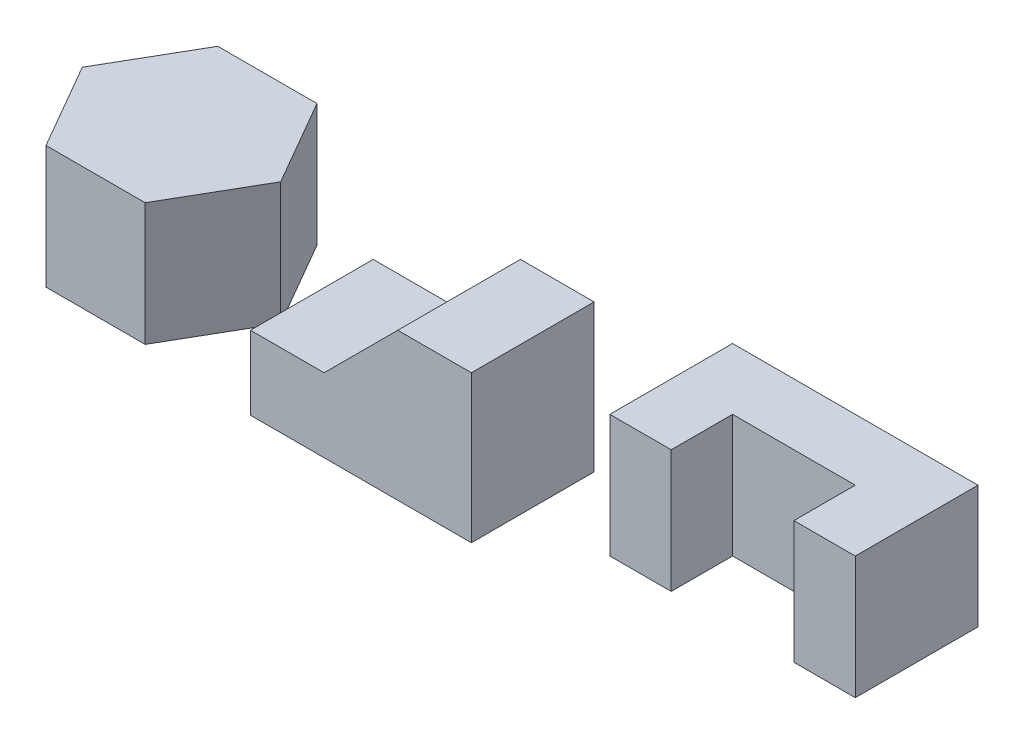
ISO-10303-21;
HEADER;
FILE_DESCRIPTION(('STEP AP214'),'2;1');
FILE_NAME('part.step','',(''),(''),'','','');
FILE_SCHEMA(('AUTOMOTIVE_DESIGN { 1 0 10303 214 1 1 1 1 }'));
ENDSEC;
DATA;
#1=APPLICATION_CONTEXT('core data for automotive mechanical design processes');
#2=APPLICATION_PROTOCOL_DEFINITION('international standard','automotive_design',2000,#1);
#3=PRODUCT_CONTEXT('',#1,'mechanical');
#4=PRODUCT('Part','Part','',(#3));
#5=PRODUCT_RELATED_PRODUCT_CATEGORY('part','',(#4));
#6=PRODUCT_DEFINITION_FORMATION('','',#4);
#7=PRODUCT_DEFINITION_CONTEXT('part definition',#1,'design');
#8=PRODUCT_DEFINITION('design','',#6,#7);
#9=PRODUCT_DEFINITION_SHAPE('','',#8);
#10=(LENGTH_UNIT() NAMED_UNIT(*) SI_UNIT(.MILLI.,.METRE.));
#11=(NAMED_UNIT(*) PLANE_ANGLE_UNIT() SI_UNIT($,.RADIAN.));
#12=(NAMED_UNIT(*) SI_UNIT($,.STERADIAN.) SOLID_ANGLE_UNIT());
#13=UNCERTAINTY_MEASURE_WITH_UNIT(LENGTH_MEASURE(1.E-05),#10,'distance_accuracy_value','');
#14=(GEOMETRIC_REPRESENTATION_CONTEXT(3) GLOBAL_UNCERTAINTY_ASSIGNED_CONTEXT((#13)) GLOBAL_UNIT_ASSIGNED_CONTEXT((#10,
#11,#12)) REPRESENTATION_CONTEXT('',''));
#15=CARTESIAN_POINT('',(0.,0.,0.));
#16=DIRECTION('',(0.,0.,1.));
#17=DIRECTION('',(1.,0.,0.));
#18=AXIS2_PLACEMENT_3D('',#15,#16,#17);
#19=CARTESIAN_POINT('',(21.6218730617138,8.29106988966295,10.));
#20=DIRECTION('',(0.,-1.,0.));
#21=DIRECTION('',(0.,0.,-1.));
#22=AXIS2_PLACEMENT_3D('',#19,#20,#21);
#23=PLANE('',#22);
#24=DIRECTION('',(-1.,0.,0.));
#25=VECTOR('',#24,1.);
#26=CARTESIAN_POINT('',(21.6218730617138,8.29106988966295,0.));
#27=LINE('',#26,#25);
#28=CARTESIAN_POINT('',(21.6218730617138,8.29106988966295,0.));
#29=VERTEX_POINT('',#28);
#30=CARTESIAN_POINT('',(15.6218730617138,8.29106988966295,0.));
#31=VERTEX_POINT('',#30);
#32=EDGE_CURVE('E126',#29,#31,#27,.T.);
#33=ORIENTED_EDGE('',*,*,#32,.T.);
#34=DIRECTION('',(0.,0.,-1.));
#35=VECTOR('',#34,1.);
#36=CARTESIAN_POINT('',(15.6218730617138,8.29106988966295,10.));
#37=LINE('',#36,#35);
#38=CARTESIAN_POINT('',(15.6218730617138,8.29106988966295,10.));
#39=VERTEX_POINT('',#38);
#40=EDGE_CURVE('E12',#39,#31,#37,.T.);
#41=ORIENTED_EDGE('',*,*,#40,.F.);
#42=DIRECTION('',(-1.,0.,0.));
#43=VECTOR('',#42,1.);
#44=CARTESIAN_POINT('',(21.6218730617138,8.29106988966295,10.));
#45=LINE('',#44,#43);
#46=CARTESIAN_POINT('',(21.6218730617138,8.29106988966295,10.));
#47=VERTEX_POINT('',#46);
#48=EDGE_CURVE('E136',#47,#39,#45,.T.);
#49=ORIENTED_EDGE('',*,*,#48,.F.);
#50=DIRECTION('',(0.,0.,-1.));
#51=VECTOR('',#50,1.);
#52=CARTESIAN_POINT('',(21.6218730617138,8.29106988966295,10.));
#53=LINE('',#52,#51);
#54=EDGE_CURVE('E122',#47,#29,#53,.T.);
#55=ORIENTED_EDGE('',*,*,#54,.T.);
#56=EDGE_LOOP('',(#33,#41,#49,#55));
#57=FACE_BOUND('',#56,.T.);
#58=ADVANCED_FACE('F42',(#57),#23,.F.);
#59=CARTESIAN_POINT('',(15.6218730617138,8.29106988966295,10.));
#60=DIRECTION('',(1.,0.,0.));
#61=DIRECTION('',(0.,1.,0.));
#62=AXIS2_PLACEMENT_3D('',#59,#60,#61);
#63=PLANE('',#62);
#64=DIRECTION('',(0.,-1.,0.));
#65=VECTOR('',#64,1.);
#66=CARTESIAN_POINT('',(15.6218730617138,8.29106988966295,0.));
#67=LINE('',#66,#65);
#68=CARTESIAN_POINT('',(15.6218730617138,2.29106988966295,0.));
#69=VERTEX_POINT('',#68);
#70=EDGE_CURVE('E129',#31,#69,#67,.T.);
#71=ORIENTED_EDGE('',*,*,#70,.T.);
#72=DIRECTION('',(0.,0.,-1.));
#73=VECTOR('',#72,1.);
#74=CARTESIAN_POINT('',(15.6218730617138,2.29106988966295,10.));
#75=LINE('',#74,#73);
#76=CARTESIAN_POINT('',(15.6218730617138,2.29106988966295,10.));
#77=VERTEX_POINT('',#76);
#78=EDGE_CURVE('E50',#77,#69,#75,.T.);
#79=ORIENTED_EDGE('',*,*,#78,.F.);
#80=DIRECTION('',(0.,-1.,0.));
#81=VECTOR('',#80,1.);
#82=CARTESIAN_POINT('',(15.6218730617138,8.29106988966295,10.));
#83=LINE('',#82,#81);
#84=EDGE_CURVE('E95',#39,#77,#83,.T.);
#85=ORIENTED_EDGE('',*,*,#84,.F.);
#86=ORIENTED_EDGE('',*,*,#40,.T.);
#87=EDGE_LOOP('',(#71,#79,#85,#86));
#88=FACE_BOUND('',#87,.T.);
#89=ADVANCED_FACE('F160',(#88),#63,.F.);
#90=CARTESIAN_POINT('',(15.6218730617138,2.29106988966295,10.));
#91=DIRECTION('',(0.,1.,0.));
#92=DIRECTION('',(0.,0.,1.));
#93=AXIS2_PLACEMENT_3D('',#90,#91,#92);
#94=PLANE('',#93);
#95=DIRECTION('',(1.,0.,0.));
#96=VECTOR('',#95,1.);
#97=CARTESIAN_POINT('',(15.6218730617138,2.29106988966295,0.));
#98=LINE('',#97,#96);
#99=CARTESIAN_POINT('',(33.6218730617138,2.29106988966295,0.));
#100=VERTEX_POINT('',#99);
#101=EDGE_CURVE('E131',#69,#100,#98,.T.);
#102=ORIENTED_EDGE('',*,*,#101,.T.);
#103=DIRECTION('',(0.,0.,-1.));
#104=VECTOR('',#103,1.);
#105=CARTESIAN_POINT('',(33.6218730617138,2.29106988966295,10.));
#106=LINE('',#105,#104);
#107=CARTESIAN_POINT('',(33.6218730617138,2.29106988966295,10.));
#108=VERTEX_POINT('',#107);
#109=EDGE_CURVE('E117',#108,#100,#106,.T.);
#110=ORIENTED_EDGE('',*,*,#109,.F.);
#111=DIRECTION('',(1.,0.,0.));
#112=VECTOR('',#111,1.);
#113=CARTESIAN_POINT('',(15.6218730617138,2.29106988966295,10.));
#114=LINE('',#113,#112);
#115=EDGE_CURVE('E108',#77,#108,#114,.T.);
#116=ORIENTED_EDGE('',*,*,#115,.F.);
#117=ORIENTED_EDGE('',*,*,#78,.T.);
#118=EDGE_LOOP('',(#102,#110,#116,#117));
#119=FACE_BOUND('',#118,.T.);
#120=ADVANCED_FACE('F142',(#119),#94,.F.);
#121=CARTESIAN_POINT('',(33.6218730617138,2.29106988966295,10.));
#122=DIRECTION('',(-1.,0.,0.));
#123=DIRECTION('',(0.,0.,1.));
#124=AXIS2_PLACEMENT_3D('',#121,#122,#123);
#125=PLANE('',#124);
#126=DIRECTION('',(0.,1.,0.));
#127=VECTOR('',#126,1.);
#128=CARTESIAN_POINT('',(33.6218730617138,2.29106988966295,0.));
#129=LINE('',#128,#127);
#130=CARTESIAN_POINT('',(33.6218730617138,14.2910698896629,0.));
#131=VERTEX_POINT('',#130);
#132=EDGE_CURVE('E116',#100,#131,#129,.T.);
#133=ORIENTED_EDGE('',*,*,#132,.T.);
#134=DIRECTION('',(0.,0.,-1.));
#135=VECTOR('',#134,1.);
#136=CARTESIAN_POINT('',(33.6218730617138,14.2910698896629,10.));
#137=LINE('',#136,#135);
#138=CARTESIAN_POINT('',(33.6218730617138,14.2910698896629,10.));
#139=VERTEX_POINT('',#138);
#140=EDGE_CURVE('E113',#139,#131,#137,.T.);
#141=ORIENTED_EDGE('',*,*,#140,.F.);
#142=DIRECTION('',(0.,1.,0.));
#143=VECTOR('',#142,1.);
#144=CARTESIAN_POINT('',(33.6218730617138,2.29106988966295,10.));
#145=LINE('',#144,#143);
#146=EDGE_CURVE('E102',#108,#139,#145,.T.);
#147=ORIENTED_EDGE('',*,*,#146,.F.);
#148=ORIENTED_EDGE('',*,*,#109,.T.);
#149=EDGE_LOOP('',(#133,#141,#147,#148));
#150=FACE_BOUND('',#149,.T.);
#151=ADVANCED_FACE('F114',(#150),#125,.F.);
#152=CARTESIAN_POINT('',(33.6218730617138,14.2910698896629,10.));
#153=DIRECTION('',(0.,-1.,0.));
#154=DIRECTION('',(1.,0.,0.));
#155=AXIS2_PLACEMENT_3D('',#152,#153,#154);
#156=PLANE('',#155);
#157=DIRECTION('',(-1.,0.,0.));
#158=VECTOR('',#157,1.);
#159=CARTESIAN_POINT('',(33.6218730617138,14.2910698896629,0.));
#160=LINE('',#159,#158);
#161=CARTESIAN_POINT('',(27.6218730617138,14.2910698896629,0.));
#162=VERTEX_POINT('',#161);
#163=EDGE_CURVE('E81',#131,#162,#160,.T.);
#164=ORIENTED_EDGE('',*,*,#163,.T.);
#165=DIRECTION('',(0.,0.,-1.));
#166=VECTOR('',#165,1.);
#167=CARTESIAN_POINT('',(27.6218730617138,14.2910698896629,10.));
#168=LINE('',#167,#166);
#169=CARTESIAN_POINT('',(27.6218730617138,14.2910698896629,10.));
#170=VERTEX_POINT('',#169);
#171=EDGE_CURVE('E118',#170,#162,#168,.T.);
#172=ORIENTED_EDGE('',*,*,#171,.F.);
#173=DIRECTION('',(-1.,0.,0.));
#174=VECTOR('',#173,1.);
#175=CARTESIAN_POINT('',(33.6218730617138,14.2910698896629,10.));
#176=LINE('',#175,#174);
#177=EDGE_CURVE('E106',#139,#170,#176,.T.);
#178=ORIENTED_EDGE('',*,*,#177,.F.);
#179=ORIENTED_EDGE('',*,*,#140,.T.);
#180=EDGE_LOOP('',(#164,#172,#178,#179));
#181=FACE_BOUND('',#180,.T.);
#182=ADVANCED_FACE('F120',(#181),#156,.F.);
#183=CARTESIAN_POINT('',(27.6218730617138,14.2910698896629,10.));
#184=DIRECTION('',(0.707106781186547,-0.707106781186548,0.));
#185=DIRECTION('',(0.707106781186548,0.707106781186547,0.));
#186=AXIS2_PLACEMENT_3D('',#183,#184,#185);
#187=PLANE('',#186);
#188=DIRECTION('',(-0.707106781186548,-0.707106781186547,0.));
#189=VECTOR('',#188,1.);
#190=CARTESIAN_POINT('',(27.6218730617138,14.2910698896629,0.));
#191=LINE('',#190,#189);
#192=EDGE_CURVE('E87',#162,#29,#191,.T.);
#193=ORIENTED_EDGE('',*,*,#192,.T.);
#194=ORIENTED_EDGE('',*,*,#54,.F.);
#195=DIRECTION('',(-0.707106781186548,-0.707106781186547,0.));
#196=VECTOR('',#195,1.);
#197=CARTESIAN_POINT('',(27.6218730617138,14.2910698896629,10.));
#198=LINE('',#197,#196);
#199=EDGE_CURVE('E58',#170,#47,#198,.T.);
#200=ORIENTED_EDGE('',*,*,#199,.F.);
#201=ORIENTED_EDGE('',*,*,#171,.T.);
#202=EDGE_LOOP('',(#193,#194,#200,#201));
#203=FACE_BOUND('',#202,.T.);
#204=ADVANCED_FACE('F149',(#203),#187,.F.);
#205=CARTESIAN_POINT('',(15.6218730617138,8.29106988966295,10.));
#206=DIRECTION('',(0.,0.,1.));
#207=DIRECTION('',(1.,0.,0.));
#208=AXIS2_PLACEMENT_3D('',#205,#206,#207);
#209=PLANE('',#208);
#210=ORIENTED_EDGE('',*,*,#48,.T.);
#211=ORIENTED_EDGE('',*,*,#84,.T.);
#212=ORIENTED_EDGE('',*,*,#115,.T.);
#213=ORIENTED_EDGE('',*,*,#146,.T.);
#214=ORIENTED_EDGE('',*,*,#177,.T.);
#215=ORIENTED_EDGE('',*,*,#199,.T.);
#216=EDGE_LOOP('',(#210,#211,#212,#213,#214,#215));
#217=FACE_BOUND('',#216,.T.);
#218=ADVANCED_FACE('F104',(#217),#209,.T.);
#219=CARTESIAN_POINT('',(15.6218730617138,8.29106988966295,0.));
#220=DIRECTION('',(0.,0.,1.));
#221=DIRECTION('',(1.,0.,0.));
#222=AXIS2_PLACEMENT_3D('',#219,#220,#221);
#223=PLANE('',#222);
#224=ORIENTED_EDGE('',*,*,#32,.F.);
#225=ORIENTED_EDGE('',*,*,#192,.F.);
#226=ORIENTED_EDGE('',*,*,#163,.F.);
#227=ORIENTED_EDGE('',*,*,#132,.F.);
#228=ORIENTED_EDGE('',*,*,#101,.F.);
#229=ORIENTED_EDGE('',*,*,#70,.F.);
#230=EDGE_LOOP('',(#224,#225,#226,#227,#228,#229));
#231=FACE_BOUND('',#230,.T.);
#232=ADVANCED_FACE('F145',(#231),#223,.F.);
#233=CLOSED_SHELL('',(#58,#89,#120,#151,#182,#204,#218,#232));
#234=MANIFOLD_SOLID_BREP('B2',#233);
#235=CARTESIAN_POINT('',(37.9066140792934,10.,-7.00000000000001));
#236=DIRECTION('',(1.,0.,0.));
#237=DIRECTION('',(0.,0.,-1.));
#238=AXIS2_PLACEMENT_3D('',#235,#236,#237);
#239=PLANE('',#238);
#240=DIRECTION('',(0.,0.,1.));
#241=VECTOR('',#240,1.);
#242=CARTESIAN_POINT('',(37.9066140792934,0.,-7.00000000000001));
#243=LINE('',#242,#241);
#244=CARTESIAN_POINT('',(37.9066140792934,0.,-7.00000000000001));
#245=VERTEX_POINT('',#244);
#246=CARTESIAN_POINT('',(37.9066140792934,0.,3.));
#247=VERTEX_POINT('',#246);
#248=EDGE_CURVE('E323',#245,#247,#243,.T.);
#249=ORIENTED_EDGE('',*,*,#248,.T.);
#250=DIRECTION('',(0.,-1.,0.));
#251=VECTOR('',#250,1.);
#252=CARTESIAN_POINT('',(37.9066140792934,10.,3.));
#253=LINE('',#252,#251);
#254=CARTESIAN_POINT('',(37.9066140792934,10.,3.));
#255=VERTEX_POINT('',#254);
#256=EDGE_CURVE('E40',#255,#247,#253,.T.);
#257=ORIENTED_EDGE('',*,*,#256,.F.);
#258=DIRECTION('',(0.,0.,1.));
#259=VECTOR('',#258,1.);
#260=CARTESIAN_POINT('',(37.9066140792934,10.,-7.00000000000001));
#261=LINE('',#260,#259);
#262=CARTESIAN_POINT('',(37.9066140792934,10.,-7.00000000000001));
#263=VERTEX_POINT('',#262);
#264=EDGE_CURVE('E337',#263,#255,#261,.T.);
#265=ORIENTED_EDGE('',*,*,#264,.F.);
#266=DIRECTION('',(0.,-1.,0.));
#267=VECTOR('',#266,1.);
#268=CARTESIAN_POINT('',(37.9066140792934,10.,-7.00000000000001));
#269=LINE('',#268,#267);
#270=EDGE_CURVE('E319',#263,#245,#269,.T.);
#271=ORIENTED_EDGE('',*,*,#270,.T.);
#272=EDGE_LOOP('',(#249,#257,#265,#271));
#273=FACE_BOUND('',#272,.T.);
#274=ADVANCED_FACE('F227',(#273),#239,.F.);
#275=CARTESIAN_POINT('',(37.9066140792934,10.,3.));
#276=DIRECTION('',(0.,0.,-1.));
#277=DIRECTION('',(-1.,0.,0.));
#278=AXIS2_PLACEMENT_3D('',#275,#276,#277);
#279=PLANE('',#278);
#280=DIRECTION('',(1.,0.,0.));
#281=VECTOR('',#280,1.);
#282=CARTESIAN_POINT('',(37.9066140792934,0.,3.));
#283=LINE('',#282,#281);
#284=CARTESIAN_POINT('',(42.9066140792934,0.,3.));
#285=VERTEX_POINT('',#284);
#286=EDGE_CURVE('E326',#247,#285,#283,.T.);
#287=ORIENTED_EDGE('',*,*,#286,.T.);
#288=DIRECTION('',(0.,-1.,0.));
#289=VECTOR('',#288,1.);
#290=CARTESIAN_POINT('',(42.9066140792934,10.,3.));
#291=LINE('',#290,#289);
#292=CARTESIAN_POINT('',(42.9066140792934,10.,3.));
#293=VERTEX_POINT('',#292);
#294=EDGE_CURVE('E235',#293,#285,#291,.T.);
#295=ORIENTED_EDGE('',*,*,#294,.F.);
#296=DIRECTION('',(1.,0.,0.));
#297=VECTOR('',#296,1.);
#298=CARTESIAN_POINT('',(37.9066140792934,10.,3.));
#299=LINE('',#298,#297);
#300=EDGE_CURVE('E286',#255,#293,#299,.T.);
#301=ORIENTED_EDGE('',*,*,#300,.F.);
#302=ORIENTED_EDGE('',*,*,#256,.T.);
#303=EDGE_LOOP('',(#287,#295,#301,#302));
#304=FACE_BOUND('',#303,.T.);
#305=ADVANCED_FACE('F372',(#304),#279,.F.);
#306=CARTESIAN_POINT('',(42.9066140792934,10.,3.));
#307=DIRECTION('',(-1.,0.,0.));
#308=DIRECTION('',(0.,0.,1.));
#309=AXIS2_PLACEMENT_3D('',#306,#307,#308);
#310=PLANE('',#309);
#311=DIRECTION('',(0.,0.,-1.));
#312=VECTOR('',#311,1.);
#313=CARTESIAN_POINT('',(42.9066140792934,0.,3.));
#314=LINE('',#313,#312);
#315=CARTESIAN_POINT('',(42.9066140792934,0.,-2.));
#316=VERTEX_POINT('',#315);
#317=EDGE_CURVE('E328',#285,#316,#314,.T.);
#318=ORIENTED_EDGE('',*,*,#317,.T.);
#319=DIRECTION('',(0.,-1.,0.));
#320=VECTOR('',#319,1.);
#321=CARTESIAN_POINT('',(42.9066140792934,10.,-2.));
#322=LINE('',#321,#320);
#323=CARTESIAN_POINT('',(42.9066140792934,10.,-2.));
#324=VERTEX_POINT('',#323);
#325=EDGE_CURVE('E344',#324,#316,#322,.T.);
#326=ORIENTED_EDGE('',*,*,#325,.F.);
#327=DIRECTION('',(0.,0.,-1.));
#328=VECTOR('',#327,1.);
#329=CARTESIAN_POINT('',(42.9066140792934,10.,3.));
#330=LINE('',#329,#328);
#331=EDGE_CURVE('E352',#293,#324,#330,.T.);
#332=ORIENTED_EDGE('',*,*,#331,.F.);
#333=ORIENTED_EDGE('',*,*,#294,.T.);
#334=EDGE_LOOP('',(#318,#326,#332,#333));
#335=FACE_BOUND('',#334,.T.);
#336=ADVANCED_FACE('F350',(#335),#310,.F.);
#337=CARTESIAN_POINT('',(42.9066140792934,10.,-2.));
#338=DIRECTION('',(0.,0.,-1.));
#339=DIRECTION('',(-1.,0.,0.));
#340=AXIS2_PLACEMENT_3D('',#337,#338,#339);
#341=PLANE('',#340);
#342=DIRECTION('',(1.,0.,0.));
#343=VECTOR('',#342,1.);
#344=CARTESIAN_POINT('',(42.9066140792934,0.,-2.));
#345=LINE('',#344,#343);
#346=CARTESIAN_POINT('',(52.9066140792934,0.,-2.));
#347=VERTEX_POINT('',#346);
#348=EDGE_CURVE('E330',#316,#347,#345,.T.);
#349=ORIENTED_EDGE('',*,*,#348,.T.);
#350=DIRECTION('',(0.,-1.,0.));
#351=VECTOR('',#350,1.);
#352=CARTESIAN_POINT('',(52.9066140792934,10.,-2.));
#353=LINE('',#352,#351);
#354=CARTESIAN_POINT('',(52.9066140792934,10.,-2.));
#355=VERTEX_POINT('',#354);
#356=EDGE_CURVE('E341',#355,#347,#353,.T.);
#357=ORIENTED_EDGE('',*,*,#356,.F.);
#358=DIRECTION('',(1.,0.,0.));
#359=VECTOR('',#358,1.);
#360=CARTESIAN_POINT('',(42.9066140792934,10.,-2.));
#361=LINE('',#360,#359);
#362=EDGE_CURVE('E364',#324,#355,#361,.T.);
#363=ORIENTED_EDGE('',*,*,#362,.F.);
#364=ORIENTED_EDGE('',*,*,#325,.T.);
#365=EDGE_LOOP('',(#349,#357,#363,#364));
#366=FACE_BOUND('',#365,.T.);
#367=ADVANCED_FACE('F360',(#366),#341,.F.);
#368=CARTESIAN_POINT('',(52.9066140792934,10.,3.));
#369=DIRECTION('',(1.,0.,0.));
#370=DIRECTION('',(0.,0.,-1.));
#371=AXIS2_PLACEMENT_3D('',#368,#369,#370);
#372=PLANE('',#371);
#373=DIRECTION('',(0.,0.,1.));
#374=VECTOR('',#373,1.);
#375=CARTESIAN_POINT('',(52.9066140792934,0.,3.));
#376=LINE('',#375,#374);
#377=CARTESIAN_POINT('',(52.9066140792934,0.,3.));
#378=VERTEX_POINT('',#377);
#379=EDGE_CURVE('E332',#347,#378,#376,.T.);
#380=ORIENTED_EDGE('',*,*,#379,.T.);
#381=DIRECTION('',(0.,-1.,0.));
#382=VECTOR('',#381,1.);
#383=CARTESIAN_POINT('',(52.9066140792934,10.,3.));
#384=LINE('',#383,#382);
#385=CARTESIAN_POINT('',(52.9066140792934,10.,3.));
#386=VERTEX_POINT('',#385);
#387=EDGE_CURVE('E314',#386,#378,#384,.T.);
#388=ORIENTED_EDGE('',*,*,#387,.F.);
#389=DIRECTION('',(0.,0.,1.));
#390=VECTOR('',#389,1.);
#391=CARTESIAN_POINT('',(52.9066140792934,10.,3.));
#392=LINE('',#391,#390);
#393=EDGE_CURVE('E305',#355,#386,#392,.T.);
#394=ORIENTED_EDGE('',*,*,#393,.F.);
#395=ORIENTED_EDGE('',*,*,#356,.T.);
#396=EDGE_LOOP('',(#380,#388,#394,#395));
#397=FACE_BOUND('',#396,.T.);
#398=ADVANCED_FACE('F363',(#397),#372,.F.);
#399=CARTESIAN_POINT('',(57.9066140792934,10.,3.));
#400=DIRECTION('',(0.,0.,-1.));
#401=DIRECTION('',(-1.,0.,0.));
#402=AXIS2_PLACEMENT_3D('',#399,#400,#401);
#403=PLANE('',#402);
#404=DIRECTION('',(1.,0.,0.));
#405=VECTOR('',#404,1.);
#406=CARTESIAN_POINT('',(57.9066140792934,0.,3.));
#407=LINE('',#406,#405);
#408=CARTESIAN_POINT('',(57.9066140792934,0.,3.));
#409=VERTEX_POINT('',#408);
#410=EDGE_CURVE('E313',#378,#409,#407,.T.);
#411=ORIENTED_EDGE('',*,*,#410,.T.);
#412=DIRECTION('',(0.,-1.,0.));
#413=VECTOR('',#412,1.);
#414=CARTESIAN_POINT('',(57.9066140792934,10.,3.));
#415=LINE('',#414,#413);
#416=CARTESIAN_POINT('',(57.9066140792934,10.,3.));
#417=VERTEX_POINT('',#416);
#418=EDGE_CURVE('E310',#417,#409,#415,.T.);
#419=ORIENTED_EDGE('',*,*,#418,.F.);
#420=DIRECTION('',(1.,0.,0.));
#421=VECTOR('',#420,1.);
#422=CARTESIAN_POINT('',(57.9066140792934,10.,3.));
#423=LINE('',#422,#421);
#424=EDGE_CURVE('E299',#386,#417,#423,.T.);
#425=ORIENTED_EDGE('',*,*,#424,.F.);
#426=ORIENTED_EDGE('',*,*,#387,.T.);
#427=EDGE_LOOP('',(#411,#419,#425,#426));
#428=FACE_BOUND('',#427,.T.);
#429=ADVANCED_FACE('F311',(#428),#403,.F.);
#430=CARTESIAN_POINT('',(57.9066140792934,10.,-7.00000000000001));
#431=DIRECTION('',(-1.,0.,0.));
#432=DIRECTION('',(0.,0.,1.));
#433=AXIS2_PLACEMENT_3D('',#430,#431,#432);
#434=PLANE('',#433);
#435=DIRECTION('',(0.,0.,-1.));
#436=VECTOR('',#435,1.);
#437=CARTESIAN_POINT('',(57.9066140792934,0.,-7.00000000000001));
#438=LINE('',#437,#436);
#439=CARTESIAN_POINT('',(57.9066140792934,0.,-7.00000000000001));
#440=VERTEX_POINT('',#439);
#441=EDGE_CURVE('E272',#409,#440,#438,.T.);
#442=ORIENTED_EDGE('',*,*,#441,.T.);
#443=DIRECTION('',(0.,-1.,0.));
#444=VECTOR('',#443,1.);
#445=CARTESIAN_POINT('',(57.9066140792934,10.,-7.00000000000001));
#446=LINE('',#445,#444);
#447=CARTESIAN_POINT('',(57.9066140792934,10.,-7.00000000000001));
#448=VERTEX_POINT('',#447);
#449=EDGE_CURVE('E315',#448,#440,#446,.T.);
#450=ORIENTED_EDGE('',*,*,#449,.F.);
#451=DIRECTION('',(0.,0.,-1.));
#452=VECTOR('',#451,1.);
#453=CARTESIAN_POINT('',(57.9066140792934,10.,-7.00000000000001));
#454=LINE('',#453,#452);
#455=EDGE_CURVE('E303',#417,#448,#454,.T.);
#456=ORIENTED_EDGE('',*,*,#455,.F.);
#457=ORIENTED_EDGE('',*,*,#418,.T.);
#458=EDGE_LOOP('',(#442,#450,#456,#457));
#459=FACE_BOUND('',#458,.T.);
#460=ADVANCED_FACE('F317',(#459),#434,.F.);
#461=CARTESIAN_POINT('',(57.9066140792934,10.,-7.00000000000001));
#462=DIRECTION('',(0.,0.,1.));
#463=DIRECTION('',(1.,0.,0.));
#464=AXIS2_PLACEMENT_3D('',#461,#462,#463);
#465=PLANE('',#464);
#466=DIRECTION('',(-1.,0.,0.));
#467=VECTOR('',#466,1.);
#468=CARTESIAN_POINT('',(57.9066140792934,0.,-7.00000000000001));
#469=LINE('',#468,#467);
#470=EDGE_CURVE('E278',#440,#245,#469,.T.);
#471=ORIENTED_EDGE('',*,*,#470,.T.);
#472=ORIENTED_EDGE('',*,*,#270,.F.);
#473=DIRECTION('',(-1.,0.,0.));
#474=VECTOR('',#473,1.);
#475=CARTESIAN_POINT('',(57.9066140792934,10.,-7.00000000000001));
#476=LINE('',#475,#474);
#477=EDGE_CURVE('E243',#448,#263,#476,.T.);
#478=ORIENTED_EDGE('',*,*,#477,.F.);
#479=ORIENTED_EDGE('',*,*,#449,.T.);
#480=EDGE_LOOP('',(#471,#472,#478,#479));
#481=FACE_BOUND('',#480,.T.);
#482=ADVANCED_FACE('F388',(#481),#465,.F.);
#483=CARTESIAN_POINT('',(37.9066140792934,10.,3.));
#484=DIRECTION('',(0.,1.,0.));
#485=DIRECTION('',(0.,0.,1.));
#486=AXIS2_PLACEMENT_3D('',#483,#484,#485);
#487=PLANE('',#486);
#488=ORIENTED_EDGE('',*,*,#264,.T.);
#489=ORIENTED_EDGE('',*,*,#300,.T.);
#490=ORIENTED_EDGE('',*,*,#331,.T.);
#491=ORIENTED_EDGE('',*,*,#362,.T.);
#492=ORIENTED_EDGE('',*,*,#393,.T.);
#493=ORIENTED_EDGE('',*,*,#424,.T.);
#494=ORIENTED_EDGE('',*,*,#455,.T.);
#495=ORIENTED_EDGE('',*,*,#477,.T.);
#496=EDGE_LOOP('',(#488,#489,#490,#491,#492,#493,#494,#495));
#497=FACE_BOUND('',#496,.T.);
#498=ADVANCED_FACE('F301',(#497),#487,.T.);
#499=CARTESIAN_POINT('',(37.9066140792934,0.,3.));
#500=DIRECTION('',(0.,1.,0.));
#501=DIRECTION('',(0.,0.,1.));
#502=AXIS2_PLACEMENT_3D('',#499,#500,#501);
#503=PLANE('',#502);
#504=ORIENTED_EDGE('',*,*,#248,.F.);
#505=ORIENTED_EDGE('',*,*,#470,.F.);
#506=ORIENTED_EDGE('',*,*,#441,.F.);
#507=ORIENTED_EDGE('',*,*,#410,.F.);
#508=ORIENTED_EDGE('',*,*,#379,.F.);
#509=ORIENTED_EDGE('',*,*,#348,.F.);
#510=ORIENTED_EDGE('',*,*,#317,.F.);
#511=ORIENTED_EDGE('',*,*,#286,.F.);
#512=EDGE_LOOP('',(#504,#505,#506,#507,#508,#509,#510,#511));
#513=FACE_BOUND('',#512,.T.);
#514=ADVANCED_FACE('F356',(#513),#503,.F.);
#515=CLOSED_SHELL('',(#274,#305,#336,#367,#398,#429,#460,#482,#498,#514));
#516=MANIFOLD_SOLID_BREP('B6',#515);
#517=CARTESIAN_POINT('',(4.04145188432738,10.,7.00000000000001));
#518=DIRECTION('',(-0.866025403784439,0.,-0.5));
#519=DIRECTION('',(-0.5,0.,0.866025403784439));
#520=AXIS2_PLACEMENT_3D('',#517,#518,#519);
#521=PLANE('',#520);
#522=DIRECTION('',(0.5,0.,-0.866025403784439));
#523=VECTOR('',#522,1.);
#524=CARTESIAN_POINT('',(4.04145188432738,0.,7.00000000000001));
#525=LINE('',#524,#523);
#526=CARTESIAN_POINT('',(4.04145188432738,0.,7.00000000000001));
#527=VERTEX_POINT('',#526);
#528=CARTESIAN_POINT('',(8.08290376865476,0.,0.));
#529=VERTEX_POINT('',#528);
#530=EDGE_CURVE('E539',#527,#529,#525,.T.);
#531=ORIENTED_EDGE('',*,*,#530,.T.);
#532=DIRECTION('',(0.,-1.,0.));
#533=VECTOR('',#532,1.);
#534=CARTESIAN_POINT('',(8.08290376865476,10.,0.));
#535=LINE('',#534,#533);
#536=CARTESIAN_POINT('',(8.08290376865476,10.,0.));
#537=VERTEX_POINT('',#536);
#538=EDGE_CURVE('E225',#537,#529,#535,.T.);
#539=ORIENTED_EDGE('',*,*,#538,.F.);
#540=DIRECTION('',(0.5,0.,-0.866025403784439));
#541=VECTOR('',#540,1.);
#542=CARTESIAN_POINT('',(4.04145188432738,10.,7.00000000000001));
#543=LINE('',#542,#541);
#544=CARTESIAN_POINT('',(4.04145188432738,10.,7.00000000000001));
#545=VERTEX_POINT('',#544);
#546=EDGE_CURVE('E549',#545,#537,#543,.T.);
#547=ORIENTED_EDGE('',*,*,#546,.F.);
#548=DIRECTION('',(0.,-1.,0.));
#549=VECTOR('',#548,1.);
#550=CARTESIAN_POINT('',(4.04145188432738,10.,7.00000000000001));
#551=LINE('',#550,#549);
#552=EDGE_CURVE('E535',#545,#527,#551,.T.);
#553=ORIENTED_EDGE('',*,*,#552,.T.);
#554=EDGE_LOOP('',(#531,#539,#547,#553));
#555=FACE_BOUND('',#554,.T.);
#556=ADVANCED_FACE('F455',(#555),#521,.F.);
#557=CARTESIAN_POINT('',(8.08290376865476,10.,0.));
#558=DIRECTION('',(-0.866025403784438,0.,0.5));
#559=DIRECTION('',(0.5,0.,0.866025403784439));
#560=AXIS2_PLACEMENT_3D('',#557,#558,#559);
#561=PLANE('',#560);
#562=DIRECTION('',(-0.5,0.,-0.866025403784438));
#563=VECTOR('',#562,1.);
#564=CARTESIAN_POINT('',(8.08290376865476,0.,0.));
#565=LINE('',#564,#563);
#566=CARTESIAN_POINT('',(4.04145188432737,0.,-7.00000000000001));
#567=VERTEX_POINT('',#566);
#568=EDGE_CURVE('E542',#529,#567,#565,.T.);
#569=ORIENTED_EDGE('',*,*,#568,.T.);
#570=DIRECTION('',(0.,-1.,0.));
#571=VECTOR('',#570,1.);
#572=CARTESIAN_POINT('',(4.04145188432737,10.,-7.00000000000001));
#573=LINE('',#572,#571);
#574=CARTESIAN_POINT('',(4.04145188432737,10.,-7.00000000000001));
#575=VERTEX_POINT('',#574);
#576=EDGE_CURVE('E463',#575,#567,#573,.T.);
#577=ORIENTED_EDGE('',*,*,#576,.F.);
#578=DIRECTION('',(-0.5,0.,-0.866025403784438));
#579=VECTOR('',#578,1.);
#580=CARTESIAN_POINT('',(8.08290376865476,10.,0.));
#581=LINE('',#580,#579);
#582=EDGE_CURVE('E508',#537,#575,#581,.T.);
#583=ORIENTED_EDGE('',*,*,#582,.F.);
#584=ORIENTED_EDGE('',*,*,#538,.T.);
#585=EDGE_LOOP('',(#569,#577,#583,#584));
#586=FACE_BOUND('',#585,.T.);
#587=ADVANCED_FACE('F573',(#586),#561,.F.);
#588=CARTESIAN_POINT('',(4.04145188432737,10.,-7.00000000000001));
#589=DIRECTION('',(0.,0.,1.));
#590=DIRECTION('',(1.,0.,0.));
#591=AXIS2_PLACEMENT_3D('',#588,#589,#590);
#592=PLANE('',#591);
#593=DIRECTION('',(-1.,0.,0.));
#594=VECTOR('',#593,1.);
#595=CARTESIAN_POINT('',(4.04145188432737,0.,-7.00000000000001));
#596=LINE('',#595,#594);
#597=CARTESIAN_POINT('',(-4.04145188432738,0.,-7.00000000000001));
#598=VERTEX_POINT('',#597);
#599=EDGE_CURVE('E544',#567,#598,#596,.T.);
#600=ORIENTED_EDGE('',*,*,#599,.T.);
#601=DIRECTION('',(0.,-1.,0.));
#602=VECTOR('',#601,1.);
#603=CARTESIAN_POINT('',(-4.04145188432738,10.,-7.00000000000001));
#604=LINE('',#603,#602);
#605=CARTESIAN_POINT('',(-4.04145188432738,10.,-7.00000000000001));
#606=VERTEX_POINT('',#605);
#607=EDGE_CURVE('E530',#606,#598,#604,.T.);
#608=ORIENTED_EDGE('',*,*,#607,.F.);
#609=DIRECTION('',(-1.,0.,0.));
#610=VECTOR('',#609,1.);
#611=CARTESIAN_POINT('',(4.04145188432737,10.,-7.00000000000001));
#612=LINE('',#611,#610);
#613=EDGE_CURVE('E521',#575,#606,#612,.T.);
#614=ORIENTED_EDGE('',*,*,#613,.F.);
#615=ORIENTED_EDGE('',*,*,#576,.T.);
#616=EDGE_LOOP('',(#600,#608,#614,#615));
#617=FACE_BOUND('',#616,.T.);
#618=ADVANCED_FACE('F555',(#617),#592,.F.);
#619=CARTESIAN_POINT('',(-4.04145188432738,10.,-7.00000000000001));
#620=DIRECTION('',(0.866025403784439,0.,0.5));
#621=DIRECTION('',(0.5,0.,-0.866025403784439));
#622=AXIS2_PLACEMENT_3D('',#619,#620,#621);
#623=PLANE('',#622);
#624=DIRECTION('',(-0.5,0.,0.866025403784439));
#625=VECTOR('',#624,1.);
#626=CARTESIAN_POINT('',(-4.04145188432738,0.,-7.00000000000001));
#627=LINE('',#626,#625);
#628=CARTESIAN_POINT('',(-8.08290376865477,0.,0.));
#629=VERTEX_POINT('',#628);
#630=EDGE_CURVE('E529',#598,#629,#627,.T.);
#631=ORIENTED_EDGE('',*,*,#630,.T.);
#632=DIRECTION('',(0.,-1.,0.));
#633=VECTOR('',#632,1.);
#634=CARTESIAN_POINT('',(-8.08290376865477,10.,0.));
#635=LINE('',#634,#633);
#636=CARTESIAN_POINT('',(-8.08290376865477,10.,0.));
#637=VERTEX_POINT('',#636);
#638=EDGE_CURVE('E526',#637,#629,#635,.T.);
#639=ORIENTED_EDGE('',*,*,#638,.F.);
#640=DIRECTION('',(-0.5,0.,0.866025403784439));
#641=VECTOR('',#640,1.);
#642=CARTESIAN_POINT('',(-4.04145188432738,10.,-7.00000000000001));
#643=LINE('',#642,#641);
#644=EDGE_CURVE('E515',#606,#637,#643,.T.);
#645=ORIENTED_EDGE('',*,*,#644,.F.);
#646=ORIENTED_EDGE('',*,*,#607,.T.);
#647=EDGE_LOOP('',(#631,#639,#645,#646));
#648=FACE_BOUND('',#647,.T.);
#649=ADVANCED_FACE('F527',(#648),#623,.F.);
#650=CARTESIAN_POINT('',(-8.08290376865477,10.,0.));
#651=DIRECTION('',(0.866025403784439,0.,-0.5));
#652=DIRECTION('',(-0.5,0.,-0.866025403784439));
#653=AXIS2_PLACEMENT_3D('',#650,#651,#652);
#654=PLANE('',#653);
#655=DIRECTION('',(0.5,0.,0.866025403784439));
#656=VECTOR('',#655,1.);
#657=CARTESIAN_POINT('',(-8.08290376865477,0.,0.));
#658=LINE('',#657,#656);
#659=CARTESIAN_POINT('',(-4.04145188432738,0.,7.00000000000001));
#660=VERTEX_POINT('',#659);
#661=EDGE_CURVE('E494',#629,#660,#658,.T.);
#662=ORIENTED_EDGE('',*,*,#661,.T.);
#663=DIRECTION('',(0.,-1.,0.));
#664=VECTOR('',#663,1.);
#665=CARTESIAN_POINT('',(-4.04145188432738,10.,7.00000000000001));
#666=LINE('',#665,#664);
#667=CARTESIAN_POINT('',(-4.04145188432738,10.,7.00000000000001));
#668=VERTEX_POINT('',#667);
#669=EDGE_CURVE('E531',#668,#660,#666,.T.);
#670=ORIENTED_EDGE('',*,*,#669,.F.);
#671=DIRECTION('',(0.5,0.,0.866025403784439));
#672=VECTOR('',#671,1.);
#673=CARTESIAN_POINT('',(-8.08290376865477,10.,0.));
#674=LINE('',#673,#672);
#675=EDGE_CURVE('E519',#637,#668,#674,.T.);
#676=ORIENTED_EDGE('',*,*,#675,.F.);
#677=ORIENTED_EDGE('',*,*,#638,.T.);
#678=EDGE_LOOP('',(#662,#670,#676,#677));
#679=FACE_BOUND('',#678,.T.);
#680=ADVANCED_FACE('F533',(#679),#654,.F.);
#681=CARTESIAN_POINT('',(-4.04145188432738,10.,7.00000000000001));
#682=DIRECTION('',(0.,0.,-1.));
#683=DIRECTION('',(-1.,0.,0.));
#684=AXIS2_PLACEMENT_3D('',#681,#682,#683);
#685=PLANE('',#684);
#686=DIRECTION('',(1.,0.,0.));
#687=VECTOR('',#686,1.);
#688=CARTESIAN_POINT('',(-4.04145188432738,0.,7.00000000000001));
#689=LINE('',#688,#687);
#690=EDGE_CURVE('E500',#660,#527,#689,.T.);
#691=ORIENTED_EDGE('',*,*,#690,.T.);
#692=ORIENTED_EDGE('',*,*,#552,.F.);
#693=DIRECTION('',(1.,0.,0.));
#694=VECTOR('',#693,1.);
#695=CARTESIAN_POINT('',(-4.04145188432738,10.,7.00000000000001));
#696=LINE('',#695,#694);
#697=EDGE_CURVE('E471',#668,#545,#696,.T.);
#698=ORIENTED_EDGE('',*,*,#697,.F.);
#699=ORIENTED_EDGE('',*,*,#669,.T.);
#700=EDGE_LOOP('',(#691,#692,#698,#699));
#701=FACE_BOUND('',#700,.T.);
#702=ADVANCED_FACE('F562',(#701),#685,.F.);
#703=CARTESIAN_POINT('',(8.08290376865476,10.,0.));
#704=DIRECTION('',(0.,1.,0.));
#705=DIRECTION('',(0.,0.,1.));
#706=AXIS2_PLACEMENT_3D('',#703,#704,#705);
#707=PLANE('',#706);
#708=ORIENTED_EDGE('',*,*,#546,.T.);
#709=ORIENTED_EDGE('',*,*,#582,.T.);
#710=ORIENTED_EDGE('',*,*,#613,.T.);
#711=ORIENTED_EDGE('',*,*,#644,.T.);
#712=ORIENTED_EDGE('',*,*,#675,.T.);
#713=ORIENTED_EDGE('',*,*,#697,.T.);
#714=EDGE_LOOP('',(#708,#709,#710,#711,#712,#713));
#715=FACE_BOUND('',#714,.T.);
#716=ADVANCED_FACE('F517',(#715),#707,.T.);
#717=CARTESIAN_POINT('',(8.08290376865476,0.,0.));
#718=DIRECTION('',(0.,1.,0.));
#719=DIRECTION('',(0.,0.,1.));
#720=AXIS2_PLACEMENT_3D('',#717,#718,#719);
#721=PLANE('',#720);
#722=ORIENTED_EDGE('',*,*,#530,.F.);
#723=ORIENTED_EDGE('',*,*,#690,.F.);
#724=ORIENTED_EDGE('',*,*,#661,.F.);
#725=ORIENTED_EDGE('',*,*,#630,.F.);
#726=ORIENTED_EDGE('',*,*,#599,.F.);
#727=ORIENTED_EDGE('',*,*,#568,.F.);
#728=EDGE_LOOP('',(#722,#723,#724,#725,#726,#727));
#729=FACE_BOUND('',#728,.T.);
#730=ADVANCED_FACE('F558',(#729),#721,.F.);
#731=CLOSED_SHELL('',(#556,#587,#618,#649,#680,#702,#716,#730));
#732=MANIFOLD_SOLID_BREP('B34',#731);
#733=ADVANCED_BREP_SHAPE_REPRESENTATION('',(#18,#234,#516,#732),#14);
#734=SHAPE_DEFINITION_REPRESENTATION(#9,#733);
ENDSEC;
END-ISO-10303-21;
